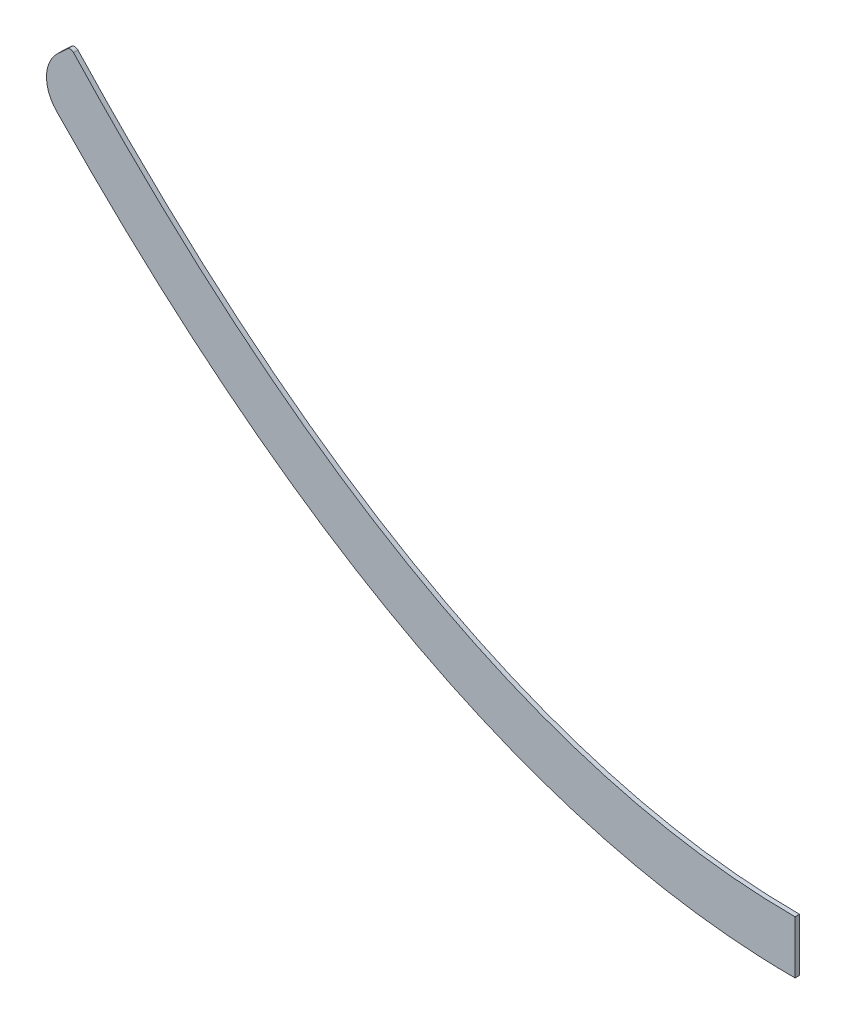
from build123d import *

# Parameters (mm, degrees)
BOSS_EXTRUDE1_DEPTH = 6.35
FILLET1_R           = 6.35
FILLET2_R           = 50.8


with BuildPart() as part:
    # Sketch1 → Boss-Extrude1 (new body)
    with BuildSketch(Plane.XY):
        with BuildLine():
            Line((1092.2, -584.2), (1092.200000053, -660.4))
            add(Edge.make_bspline(
                [(-5.087388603, -74.190172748), (-2.313568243, -77.182978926), (3.253596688, -83.166230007), (14.371791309, -95.021557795), (28.282777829, -109.679086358), (44.983808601, -126.994751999), (67.267523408, -149.72293191), (95.150039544, -177.456721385), (128.656686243, -209.654928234), (162.213165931, -240.76961224), (207.024898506, -280.809633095), (263.176496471, -328.144569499), (330.797274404, -380.588231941), (398.675890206, -428.654811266), (466.829526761, -472.320489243), (558.085229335, -524.634026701), (672.900055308, -578.864849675), (811.846430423, -625.750496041), (928.429463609, -649.357251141), (1021.97838972, -658.820984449), (1068.781921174, -660.400000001), (1092.200000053, -660.4)],
                knots=[0.488148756, 0.488148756, 0.488148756, 0.488148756, 0.488241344, 0.488333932, 0.488519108, 0.488704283, 0.488889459, 0.489259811, 0.489630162, 0.490000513, 0.490370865, 0.491111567, 0.49185227, 0.492592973, 0.493333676, 0.494074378, 0.495555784, 0.497037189, 0.498518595, 0.499259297, 0.5, 0.5, 0.5, 0.5], degree=3))
            Line((-5.087388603, -74.190172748), (50.8, -22.392105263))
            add(Edge.make_bspline(
                [(50.8, -22.392105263), (571.5, -584.2), (1092.2, -584.2)],
                knots=[0, 0, 0, 1, 1, 1], degree=2))
        make_face()
    extrude(amount=BOSS_EXTRUDE1_DEPTH)

    # Fillet1
    fillet1_edges = [part.edges().sort_by_distance(p)[0] for p in [
        (50.8, -22.392105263, 3.175),
    ]]
    fillet(fillet1_edges, radius=FILLET1_R)

    # Fillet2
    fillet2_edges = [part.edges().sort_by_distance(p)[0] for p in [
        (-5.087388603, -74.190172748, 3.175),
    ]]
    fillet(fillet2_edges, radius=FILLET2_R)


solid = part.part
